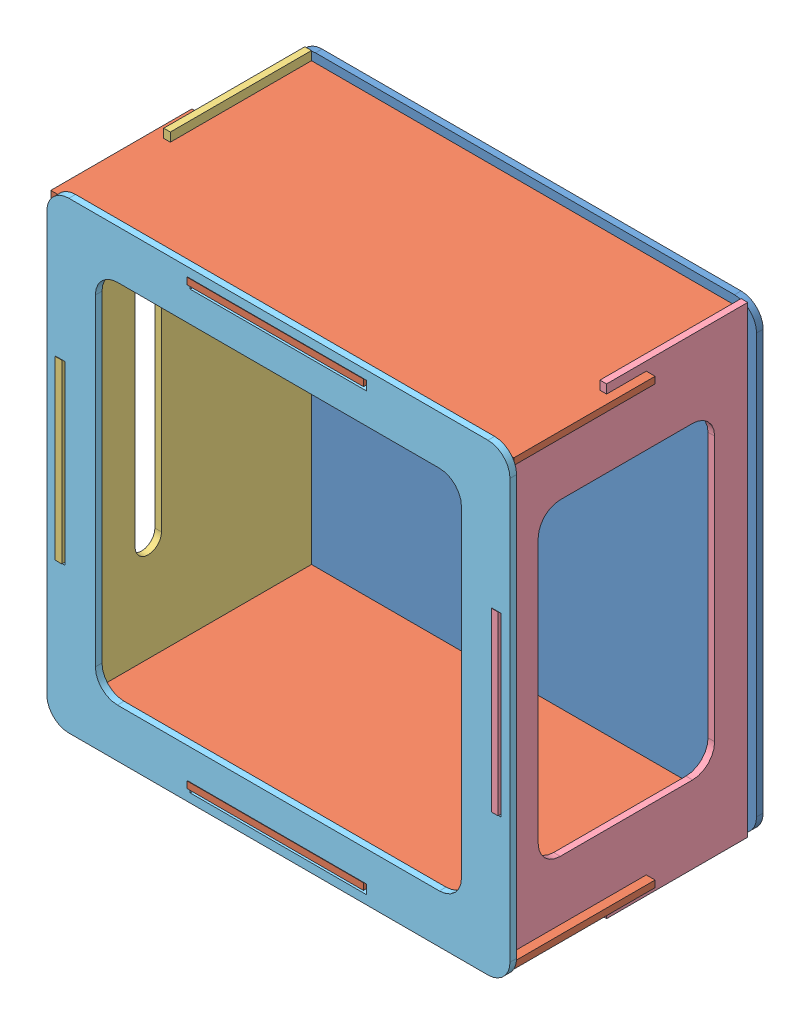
SolidWorks assembly Assemblage3.SLDASM, configuration Défaut (file format 13000). Lengths in mm.
Overall size (105.6 105 58.2).
6 component instances, 5 part files, 16 mates.
Components (placement in the parent):
- fond-1: fond.SLDPRT [Défaut] at (-11.3882 3.0042 105) size (105 105 1.5)
- cote-1: cote.SLDPRT [Défaut] at (-11.3882 52.0042 134) x (1 0 0) z (0 1 0) size (105 58.2 1.5)
- cote-2: cote.SLDPRT [Défaut] at (-11.3882 -46.8958 134) x (1 0 0) z (0 1 0) size (105 58.2 1.5)
- cote2-2: cote2.SLDPRT [Défaut] at (-61.2882 3.0042 134) x (0 -1 0) z (1 0 0) size (105 58.2 1.5)
- cote2ouvert-1: cote2ouvert.SLDPRT [Défaut] at (37.6118 3.0042 134) x (0 -1 0) z (1 0 0) size (105 58.2 1.5)
- dessus-1: dessus.SLDPRT [Défaut] at (-10.7882 3.0042 161.5) size (105 105 1.5)
Mates (geometry in assembly coordinates):
- Coïncidente1: coincident anti-aligned: plane of fond-1 through (8.6118 53.5042 106.5) normal (0 -1 0); plane of cote-1 through (-11.3882 53.5042 134) normal (0 1 0)
- Coïncidente2: coincident anti-aligned: plane of fond-1 through (-58.8882 -44.4958 106.5) normal (0 0 1); plane of cote-1 through (8.6118 53.5042 106.5) normal (0 0 -1)
- Coïncidente3: coincident anti-aligned: plane of fond-1 through (8.6118 53.5042 106.5) normal (-1 0 0); plane of cote-1 through (8.6118 53.5042 106.5) normal (1 0 0)
- Coïncidente7: coincident anti-aligned: plane of fond-1 through (-59.7882 23.0042 106.5) normal (-1 0 0); plane of cote2-2 through (-59.7882 3.0042 134) normal (1 0 0)
- Coïncidente9: coincident anti-aligned: plane of fond-1 through (-59.7882 23.0042 106.5) normal (-1 0 0); plane of cote2-2 through (-59.7882 3.0042 134) normal (1 0 0)
- Coïncidente10: coincident anti-aligned: plane of fond-1 through (-58.8882 -44.4958 106.5) normal (0 0 1); plane of cote2-2 through (-59.7882 55.5042 106.5) normal (0 0 -1)
- Coïncidente11: coincident anti-aligned: plane of fond-1 through (-61.8882 -16.9958 106.5) normal (0 1 0); plane of cote2-2 through (-59.7882 -16.9958 106.5) normal (0 -1 0)
- Coïncidente12: coincident anti-aligned: plane of fond-1 through (-31.3882 -45.3958 106.5) normal (0 -1 0); plane of cote-2 through (-11.3882 -45.3958 134) normal (0 1 0)
- Coïncidente13: coincident anti-aligned: plane of fond-1 through (-58.8882 -44.4958 106.5) normal (0 0 1); plane of cote-2 through (-59.7882 -45.3958 106.5) normal (0 0 -1)
- Coïncidente14: coincident anti-aligned: plane of fond-1 through (-31.3882 -47.4958 106.5) normal (1 0 0); plane of cote-2 through (-31.3882 -45.3958 106.5) normal (-1 0 0)
- Coïncidente15: coincident anti-aligned: plane of fond-1 through (39.1118 -16.9958 106.5) normal (-1 0 0); plane of cote2ouvert-1 through (39.1118 3.0042 134) normal (1 0 0)
- Coïncidente16: coincident anti-aligned: plane of fond-1 through (-58.8882 -44.4958 106.5) normal (0 0 1); plane of cote2ouvert-1 through (39.1118 55.5042 106.5) normal (0 0 -1)
- Coïncidente17: coincident anti-aligned: plane of fond-1 through (39.1118 23.0042 106.5) normal (0 -1 0); plane of cote2ouvert-1 through (39.1118 23.0042 106.5) normal (0 1 0)
- Coïncidente18: coincident anti-aligned: plane of cote2ouvert-1 through (39.1118 -16.9958 161.5) normal (0 0 1); plane of dessus-1 through (36.7118 -44.4958 161.5) normal (0 0 -1)
- Coïncidente19: coincident anti-aligned: plane of cote2ouvert-1 through (37.6118 3.0042 134) normal (-1 0 0); plane of dessus-1 through (37.6118 -16.9958 163) normal (1 0 0)
- Coïncidente20: coincident anti-aligned: plane of cote2ouvert-1 through (39.1118 23.0042 161.5) normal (0 1 0); plane of dessus-1 through (39.7118 23.0042 163) normal (0 -1 0)
